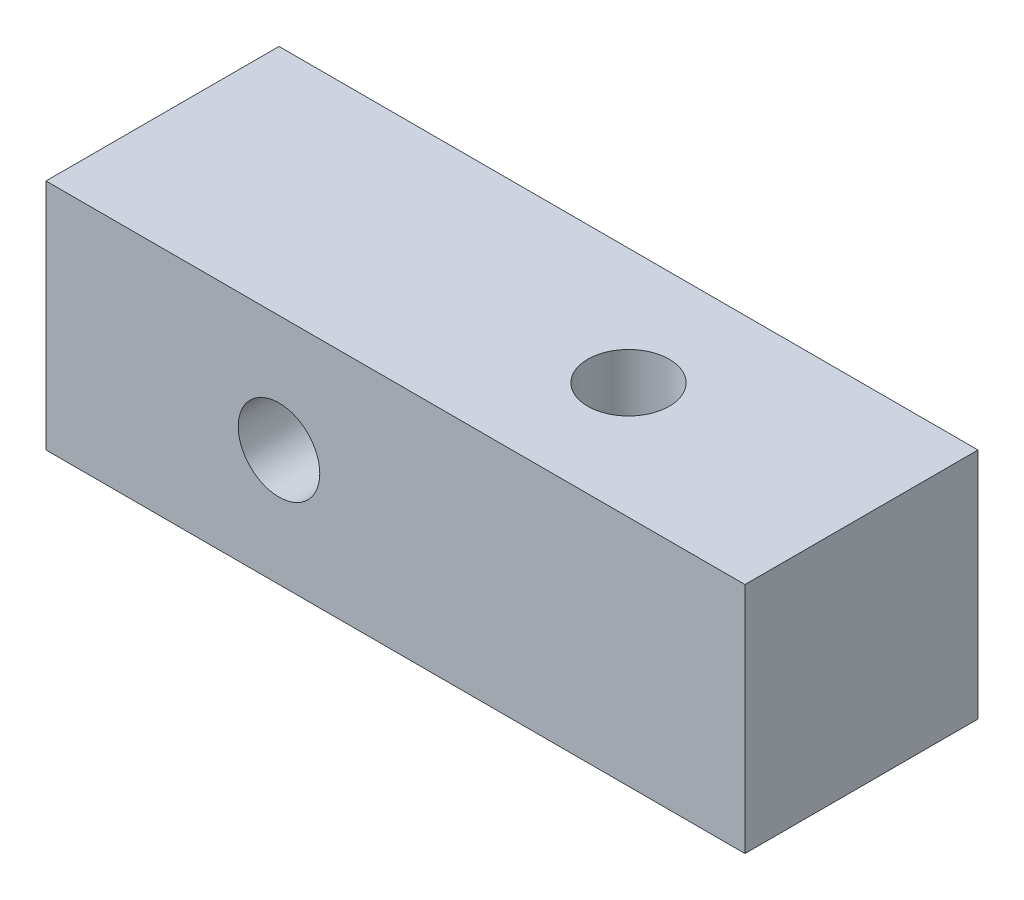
ISO-10303-21;
HEADER;
FILE_DESCRIPTION(('STEP AP214'),'2;1');
FILE_NAME('part.step','',(''),(''),'','','');
FILE_SCHEMA(('AUTOMOTIVE_DESIGN { 1 0 10303 214 1 1 1 1 }'));
ENDSEC;
DATA;
#1=APPLICATION_CONTEXT('core data for automotive mechanical design processes');
#2=APPLICATION_PROTOCOL_DEFINITION('international standard','automotive_design',2000,#1);
#3=PRODUCT_CONTEXT('',#1,'mechanical');
#4=PRODUCT('Part','Part','',(#3));
#5=PRODUCT_RELATED_PRODUCT_CATEGORY('part','',(#4));
#6=PRODUCT_DEFINITION_FORMATION('','',#4);
#7=PRODUCT_DEFINITION_CONTEXT('part definition',#1,'design');
#8=PRODUCT_DEFINITION('design','',#6,#7);
#9=PRODUCT_DEFINITION_SHAPE('','',#8);
#10=(LENGTH_UNIT() NAMED_UNIT(*) SI_UNIT(.MILLI.,.METRE.));
#11=(NAMED_UNIT(*) PLANE_ANGLE_UNIT() SI_UNIT($,.RADIAN.));
#12=(NAMED_UNIT(*) SI_UNIT($,.STERADIAN.) SOLID_ANGLE_UNIT());
#13=UNCERTAINTY_MEASURE_WITH_UNIT(LENGTH_MEASURE(1.E-05),#10,'distance_accuracy_value','');
#14=(GEOMETRIC_REPRESENTATION_CONTEXT(3) GLOBAL_UNCERTAINTY_ASSIGNED_CONTEXT((#13)) GLOBAL_UNIT_ASSIGNED_CONTEXT((#10,
#11,#12)) REPRESENTATION_CONTEXT('',''));
#15=CARTESIAN_POINT('',(0.,0.,0.));
#16=DIRECTION('',(0.,0.,1.));
#17=DIRECTION('',(1.,0.,0.));
#18=AXIS2_PLACEMENT_3D('',#15,#16,#17);
#19=CARTESIAN_POINT('',(0.,0.,10.));
#20=DIRECTION('',(0.,0.,1.));
#21=DIRECTION('',(1.,0.,0.));
#22=AXIS2_PLACEMENT_3D('',#19,#20,#21);
#23=PLANE('',#22);
#24=DIRECTION('',(0.,-1.,0.));
#25=VECTOR('',#24,1.);
#26=CARTESIAN_POINT('',(-43.5113208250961,0.111063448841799,10.));
#27=LINE('',#26,#25);
#28=CARTESIAN_POINT('',(-43.5113208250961,0.111063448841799,10.));
#29=VERTEX_POINT('',#28);
#30=CARTESIAN_POINT('',(-43.5113208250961,-9.8889365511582,10.));
#31=VERTEX_POINT('',#30);
#32=EDGE_CURVE('E101',#29,#31,#27,.T.);
#33=ORIENTED_EDGE('',*,*,#32,.T.);
#34=DIRECTION('',(1.,0.,0.));
#35=VECTOR('',#34,1.);
#36=CARTESIAN_POINT('',(-43.5113208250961,-9.8889365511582,10.));
#37=LINE('',#36,#35);
#38=CARTESIAN_POINT('',(-13.5113208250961,-9.8889365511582,10.));
#39=VERTEX_POINT('',#38);
#40=EDGE_CURVE('E96',#31,#39,#37,.T.);
#41=ORIENTED_EDGE('',*,*,#40,.T.);
#42=DIRECTION('',(0.,1.,0.));
#43=VECTOR('',#42,1.);
#44=CARTESIAN_POINT('',(-13.5113208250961,0.111063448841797,10.));
#45=LINE('',#44,#43);
#46=CARTESIAN_POINT('',(-13.5113208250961,0.111063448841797,10.));
#47=VERTEX_POINT('',#46);
#48=EDGE_CURVE('E99',#39,#47,#45,.T.);
#49=ORIENTED_EDGE('',*,*,#48,.T.);
#50=DIRECTION('',(-1.,0.,0.));
#51=VECTOR('',#50,1.);
#52=CARTESIAN_POINT('',(-43.5113208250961,0.111063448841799,10.));
#53=LINE('',#52,#51);
#54=EDGE_CURVE('E66',#47,#29,#53,.T.);
#55=ORIENTED_EDGE('',*,*,#54,.T.);
#56=EDGE_LOOP('',(#33,#41,#49,#55));
#57=FACE_BOUND('',#56,.T.);
#58=CARTESIAN_POINT('',(-33.5113208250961,-4.8889365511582,10.));
#59=DIRECTION('',(0.,0.,1.));
#60=DIRECTION('',(1.,0.,0.));
#61=AXIS2_PLACEMENT_3D('',#58,#59,#60);
#62=CIRCLE('',#61,1.75);
#63=CARTESIAN_POINT('',(-31.7613208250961,-4.8889365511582,10.));
#64=VERTEX_POINT('',#63);
#65=EDGE_CURVE('E116',#64,#64,#62,.T.);
#66=ORIENTED_EDGE('',*,*,#65,.F.);
#67=EDGE_LOOP('',(#66));
#68=FACE_BOUND('',#67,.T.);
#69=ADVANCED_FACE('F49',(#57,#68),#23,.T.);
#70=CARTESIAN_POINT('',(0.,0.,0.));
#71=DIRECTION('',(0.,0.,1.));
#72=DIRECTION('',(1.,0.,0.));
#73=AXIS2_PLACEMENT_3D('',#70,#71,#72);
#74=PLANE('',#73);
#75=DIRECTION('',(0.,-1.,0.));
#76=VECTOR('',#75,1.);
#77=CARTESIAN_POINT('',(-43.5113208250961,0.111063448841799,0.));
#78=LINE('',#77,#76);
#79=CARTESIAN_POINT('',(-43.5113208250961,0.111063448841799,0.));
#80=VERTEX_POINT('',#79);
#81=CARTESIAN_POINT('',(-43.5113208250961,-9.8889365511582,0.));
#82=VERTEX_POINT('',#81);
#83=EDGE_CURVE('E113',#80,#82,#78,.T.);
#84=ORIENTED_EDGE('',*,*,#83,.F.);
#85=DIRECTION('',(-1.,0.,0.));
#86=VECTOR('',#85,1.);
#87=CARTESIAN_POINT('',(-43.5113208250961,0.111063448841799,0.));
#88=LINE('',#87,#86);
#89=CARTESIAN_POINT('',(-13.5113208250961,0.111063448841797,0.));
#90=VERTEX_POINT('',#89);
#91=EDGE_CURVE('E89',#90,#80,#88,.T.);
#92=ORIENTED_EDGE('',*,*,#91,.F.);
#93=DIRECTION('',(0.,1.,0.));
#94=VECTOR('',#93,1.);
#95=CARTESIAN_POINT('',(-13.5113208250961,0.111063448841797,0.));
#96=LINE('',#95,#94);
#97=CARTESIAN_POINT('',(-13.5113208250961,-9.8889365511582,0.));
#98=VERTEX_POINT('',#97);
#99=EDGE_CURVE('E83',#98,#90,#96,.T.);
#100=ORIENTED_EDGE('',*,*,#99,.F.);
#101=DIRECTION('',(1.,0.,0.));
#102=VECTOR('',#101,1.);
#103=CARTESIAN_POINT('',(-43.5113208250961,-9.8889365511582,0.));
#104=LINE('',#103,#102);
#105=EDGE_CURVE('E105',#82,#98,#104,.T.);
#106=ORIENTED_EDGE('',*,*,#105,.F.);
#107=EDGE_LOOP('',(#84,#92,#100,#106));
#108=FACE_BOUND('',#107,.T.);
#109=CARTESIAN_POINT('',(-33.5113208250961,-4.8889365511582,0.));
#110=DIRECTION('',(0.,0.,1.));
#111=DIRECTION('',(1.,0.,0.));
#112=AXIS2_PLACEMENT_3D('',#109,#110,#111);
#113=CIRCLE('',#112,1.75);
#114=CARTESIAN_POINT('',(-31.7613208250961,-4.8889365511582,0.));
#115=VERTEX_POINT('',#114);
#116=EDGE_CURVE('E128',#115,#115,#113,.T.);
#117=ORIENTED_EDGE('',*,*,#116,.T.);
#118=EDGE_LOOP('',(#117));
#119=FACE_BOUND('',#118,.T.);
#120=ADVANCED_FACE('F124',(#108,#119),#74,.F.);
#121=CARTESIAN_POINT('',(-43.5113208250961,0.111063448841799,10.));
#122=DIRECTION('',(1.,0.,0.));
#123=DIRECTION('',(0.,0.,-1.));
#124=AXIS2_PLACEMENT_3D('',#121,#122,#123);
#125=PLANE('',#124);
#126=ORIENTED_EDGE('',*,*,#83,.T.);
#127=DIRECTION('',(0.,0.,-1.));
#128=VECTOR('',#127,1.);
#129=CARTESIAN_POINT('',(-43.5113208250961,-9.8889365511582,10.));
#130=LINE('',#129,#128);
#131=EDGE_CURVE('E13',#31,#82,#130,.T.);
#132=ORIENTED_EDGE('',*,*,#131,.F.);
#133=ORIENTED_EDGE('',*,*,#32,.F.);
#134=DIRECTION('',(0.,0.,-1.));
#135=VECTOR('',#134,1.);
#136=CARTESIAN_POINT('',(-43.5113208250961,0.111063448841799,10.));
#137=LINE('',#136,#135);
#138=EDGE_CURVE('E109',#29,#80,#137,.T.);
#139=ORIENTED_EDGE('',*,*,#138,.T.);
#140=EDGE_LOOP('',(#126,#132,#133,#139));
#141=FACE_BOUND('',#140,.T.);
#142=ADVANCED_FACE('F51',(#141),#125,.F.);
#143=CARTESIAN_POINT('',(-43.5113208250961,-9.8889365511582,10.));
#144=DIRECTION('',(0.,1.,0.));
#145=DIRECTION('',(0.,0.,1.));
#146=AXIS2_PLACEMENT_3D('',#143,#144,#145);
#147=PLANE('',#146);
#148=CARTESIAN_POINT('',(-23.5113208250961,-9.8889365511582,5.));
#149=DIRECTION('',(0.,1.,0.));
#150=DIRECTION('',(-1.,0.,0.));
#151=AXIS2_PLACEMENT_3D('',#148,#149,#150);
#152=CIRCLE('',#151,1.75);
#153=CARTESIAN_POINT('',(-25.2613208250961,-9.8889365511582,5.));
#154=VERTEX_POINT('',#153);
#155=EDGE_CURVE('E131',#154,#154,#152,.T.);
#156=ORIENTED_EDGE('',*,*,#155,.T.);
#157=EDGE_LOOP('',(#156));
#158=FACE_BOUND('',#157,.T.);
#159=ORIENTED_EDGE('',*,*,#105,.T.);
#160=DIRECTION('',(0.,0.,-1.));
#161=VECTOR('',#160,1.);
#162=CARTESIAN_POINT('',(-13.5113208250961,-9.8889365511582,10.));
#163=LINE('',#162,#161);
#164=EDGE_CURVE('E58',#39,#98,#163,.T.);
#165=ORIENTED_EDGE('',*,*,#164,.F.);
#166=ORIENTED_EDGE('',*,*,#40,.F.);
#167=ORIENTED_EDGE('',*,*,#131,.T.);
#168=EDGE_LOOP('',(#159,#165,#166,#167));
#169=FACE_BOUND('',#168,.T.);
#170=ADVANCED_FACE('F104',(#158,#169),#147,.F.);
#171=CARTESIAN_POINT('',(-13.5113208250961,0.111063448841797,10.));
#172=DIRECTION('',(-1.,0.,0.));
#173=DIRECTION('',(0.,0.,1.));
#174=AXIS2_PLACEMENT_3D('',#171,#172,#173);
#175=PLANE('',#174);
#176=ORIENTED_EDGE('',*,*,#99,.T.);
#177=DIRECTION('',(0.,0.,-1.));
#178=VECTOR('',#177,1.);
#179=CARTESIAN_POINT('',(-13.5113208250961,0.111063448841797,10.));
#180=LINE('',#179,#178);
#181=EDGE_CURVE('E106',#47,#90,#180,.T.);
#182=ORIENTED_EDGE('',*,*,#181,.F.);
#183=ORIENTED_EDGE('',*,*,#48,.F.);
#184=ORIENTED_EDGE('',*,*,#164,.T.);
#185=EDGE_LOOP('',(#176,#182,#183,#184));
#186=FACE_BOUND('',#185,.T.);
#187=ADVANCED_FACE('F107',(#186),#175,.F.);
#188=CARTESIAN_POINT('',(-43.5113208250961,0.111063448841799,10.));
#189=DIRECTION('',(0.,-1.,0.));
#190=DIRECTION('',(1.,0.,0.));
#191=AXIS2_PLACEMENT_3D('',#188,#189,#190);
#192=PLANE('',#191);
#193=CARTESIAN_POINT('',(-23.5113208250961,0.111063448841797,5.));
#194=DIRECTION('',(0.,1.,0.));
#195=DIRECTION('',(-1.,0.,0.));
#196=AXIS2_PLACEMENT_3D('',#193,#194,#195);
#197=CIRCLE('',#196,1.75);
#198=CARTESIAN_POINT('',(-25.2613208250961,0.111063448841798,5.));
#199=VERTEX_POINT('',#198);
#200=EDGE_CURVE('E134',#199,#199,#197,.T.);
#201=ORIENTED_EDGE('',*,*,#200,.F.);
#202=EDGE_LOOP('',(#201));
#203=FACE_BOUND('',#202,.T.);
#204=ORIENTED_EDGE('',*,*,#91,.T.);
#205=ORIENTED_EDGE('',*,*,#138,.F.);
#206=ORIENTED_EDGE('',*,*,#54,.F.);
#207=ORIENTED_EDGE('',*,*,#181,.T.);
#208=EDGE_LOOP('',(#204,#205,#206,#207));
#209=FACE_BOUND('',#208,.T.);
#210=ADVANCED_FACE('F121',(#203,#209),#192,.F.);
#211=CARTESIAN_POINT('',(-33.5113208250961,-4.8889365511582,10.));
#212=DIRECTION('',(0.,0.,-1.));
#213=DIRECTION('',(-1.,0.,0.));
#214=AXIS2_PLACEMENT_3D('',#211,#212,#213);
#215=CYLINDRICAL_SURFACE('',#214,1.75);
#216=ORIENTED_EDGE('',*,*,#65,.T.);
#217=EDGE_LOOP('',(#216));
#218=FACE_BOUND('',#217,.T.);
#219=ORIENTED_EDGE('',*,*,#116,.F.);
#220=EDGE_LOOP('',(#219));
#221=FACE_BOUND('',#220,.T.);
#222=ADVANCED_FACE('F144',(#218,#221),#215,.F.);
#223=CARTESIAN_POINT('',(-23.5113208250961,-9.8889365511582,5.));
#224=DIRECTION('',(0.,1.,0.));
#225=DIRECTION('',(-1.,0.,0.));
#226=AXIS2_PLACEMENT_3D('',#223,#224,#225);
#227=CYLINDRICAL_SURFACE('',#226,1.75);
#228=ORIENTED_EDGE('',*,*,#155,.F.);
#229=EDGE_LOOP('',(#228));
#230=FACE_BOUND('',#229,.T.);
#231=ORIENTED_EDGE('',*,*,#200,.T.);
#232=EDGE_LOOP('',(#231));
#233=FACE_BOUND('',#232,.T.);
#234=ADVANCED_FACE('F141',(#230,#233),#227,.F.);
#235=CLOSED_SHELL('',(#69,#120,#142,#170,#187,#210,#222,#234));
#236=MANIFOLD_SOLID_BREP('B2',#235);
#237=ADVANCED_BREP_SHAPE_REPRESENTATION('',(#18,#236),#14);
#238=SHAPE_DEFINITION_REPRESENTATION(#9,#237);
ENDSEC;
END-ISO-10303-21;
